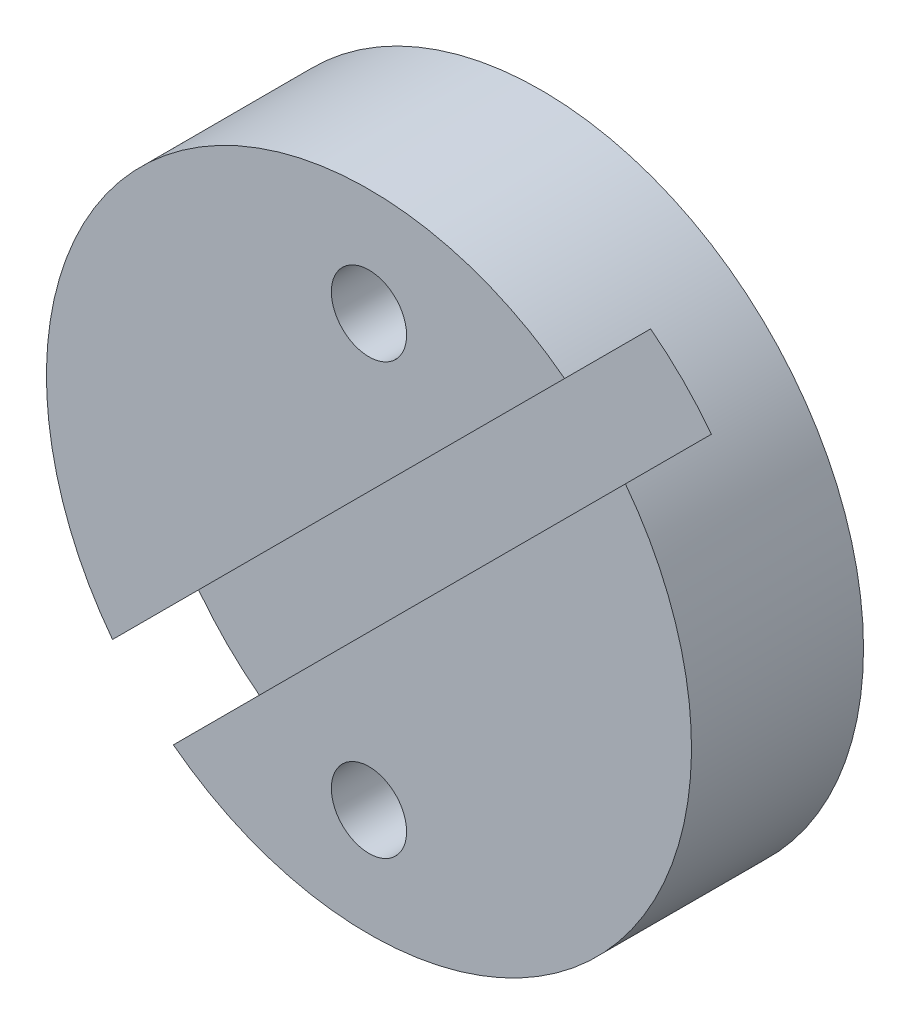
from build123d import *

# Parameters (mm, degrees)
ESQUISSE1_R             = 15
ESQUISSE1_R_2           = 1.75
EXTRUSION1_DEPTH        = 8
ESQUISSE3_W             = 37.918179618
ESQUISSE3_H             = 4
ENL_V_MAT_EXTRU_1_DEPTH = 4


with BuildPart() as part:
    # Esquisse1 → Extrusion1 (new body)
    with BuildSketch(Plane.XY):
        Circle(ESQUISSE1_R)
        with Locations((0, 10)):
            Circle(ESQUISSE1_R_2, mode=Mode.SUBTRACT)
        with Locations((0, -10)):
            Circle(ESQUISSE1_R_2, mode=Mode.SUBTRACT)
    extrude(amount=EXTRUSION1_DEPTH)

    # Esquisse3 → Enl_v. mat.-Extru.1 (cut)
    with BuildSketch(Plane(origin=(0, 0, 8), x_dir=(0.7071067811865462, 0.7071067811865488, 0), z_dir=(0, 0, 1))):
        with Locations((-0.266279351, 0)):
            Rectangle(ESQUISSE3_W, ESQUISSE3_H)
    extrude(amount=-ENL_V_MAT_EXTRU_1_DEPTH, mode=Mode.SUBTRACT)


solid = part.part
